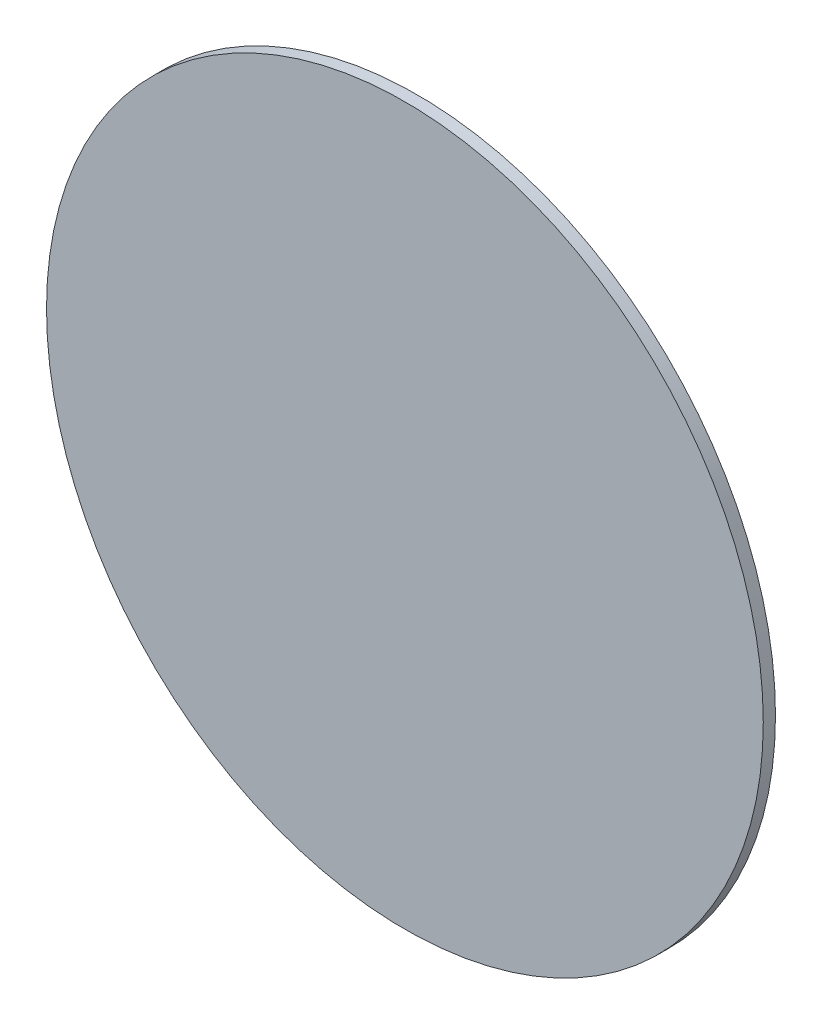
from build123d import *

# Parameters (mm, degrees)
FILLET1_R = 0.635


with BuildPart() as part:
    # Sketch1 → Revolve1 (revolve)
    with BuildSketch(Plane(origin=(0, 0, 0), x_dir=(0, 0, -1), z_dir=(1, 0, 0)), mode=Mode.PRIVATE) as revolve1_sk:
        Polygon((0, 0), (0, 8.9535), (0.3048, 8.9535), (0.3048, 5.3975), (0.889, 4.445), (0.889, 0), align=None)
    revolve(revolve1_sk.sketch.rotate(Axis((0, 0, 3.928924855), (0, 0, -1)), 90), axis=Axis((0, 0, 3.928924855), (0, 0, -1)))

    # Fillet1
    fillet1_edges = [part.edges().sort_by_distance(p)[0] for p in [
        (-4.445, 0, -0.889),
        (-5.3975, 0, -0.3048),
    ]]
    fillet(fillet1_edges, radius=FILLET1_R)


solid = part.part
